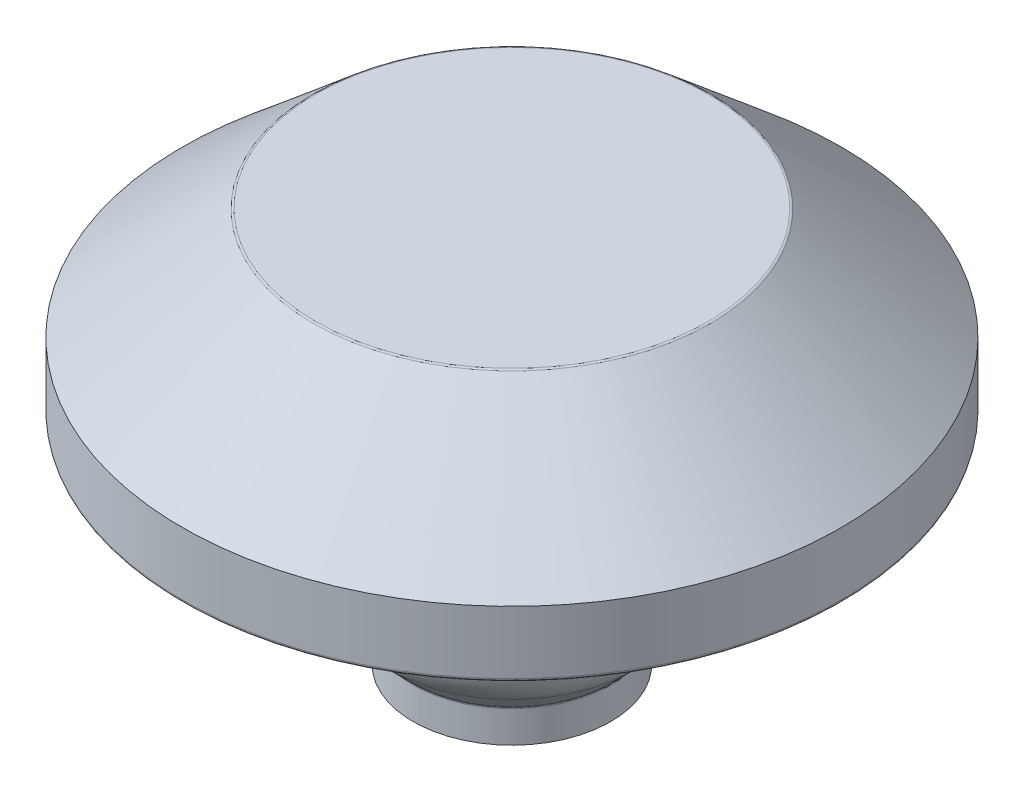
ISO-10303-21;
HEADER;
FILE_DESCRIPTION(('STEP AP214'),'2;1');
FILE_NAME('part.step','',(''),(''),'','','');
FILE_SCHEMA(('AUTOMOTIVE_DESIGN { 1 0 10303 214 1 1 1 1 }'));
ENDSEC;
DATA;
#1=APPLICATION_CONTEXT('core data for automotive mechanical design processes');
#2=APPLICATION_PROTOCOL_DEFINITION('international standard','automotive_design',2000,#1);
#3=PRODUCT_CONTEXT('',#1,'mechanical');
#4=PRODUCT('Part','Part','',(#3));
#5=PRODUCT_RELATED_PRODUCT_CATEGORY('part','',(#4));
#6=PRODUCT_DEFINITION_FORMATION('','',#4);
#7=PRODUCT_DEFINITION_CONTEXT('part definition',#1,'design');
#8=PRODUCT_DEFINITION('design','',#6,#7);
#9=PRODUCT_DEFINITION_SHAPE('','',#8);
#10=(LENGTH_UNIT() NAMED_UNIT(*) SI_UNIT(.MILLI.,.METRE.));
#11=(NAMED_UNIT(*) PLANE_ANGLE_UNIT() SI_UNIT($,.RADIAN.));
#12=(NAMED_UNIT(*) SI_UNIT($,.STERADIAN.) SOLID_ANGLE_UNIT());
#13=UNCERTAINTY_MEASURE_WITH_UNIT(LENGTH_MEASURE(1.E-05),#10,'distance_accuracy_value','');
#14=(GEOMETRIC_REPRESENTATION_CONTEXT(3) GLOBAL_UNCERTAINTY_ASSIGNED_CONTEXT((#13)) GLOBAL_UNIT_ASSIGNED_CONTEXT((#10,
#11,#12)) REPRESENTATION_CONTEXT('',''));
#15=CARTESIAN_POINT('',(0.,0.,0.));
#16=DIRECTION('',(0.,0.,1.));
#17=DIRECTION('',(1.,0.,0.));
#18=AXIS2_PLACEMENT_3D('',#15,#16,#17);
#19=CARTESIAN_POINT('',(0.,6.,0.));
#20=DIRECTION('',(0.,1.,0.));
#21=DIRECTION('',(0.,0.,1.));
#22=AXIS2_PLACEMENT_3D('',#19,#20,#21);
#23=PLANE('',#22);
#24=CARTESIAN_POINT('',(0.,6.,0.));
#25=DIRECTION('',(0.,1.,0.));
#26=DIRECTION('',(0.,0.,1.));
#27=AXIS2_PLACEMENT_3D('',#24,#25,#26);
#28=CIRCLE('',#27,2.98162114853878);
#29=CARTESIAN_POINT('',(0.,6.,2.98162114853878));
#30=VERTEX_POINT('',#29);
#31=EDGE_CURVE('E65',#30,#30,#28,.T.);
#32=ORIENTED_EDGE('',*,*,#31,.T.);
#33=EDGE_LOOP('',(#32));
#34=FACE_BOUND('',#33,.T.);
#35=ADVANCED_FACE('F39',(#34),#23,.T.);
#36=CARTESIAN_POINT('',(0.,4.3,0.));
#37=DIRECTION('',(0.,-1.,0.));
#38=DIRECTION('',(0.,0.,-1.));
#39=AXIS2_PLACEMENT_3D('',#36,#37,#38);
#40=CONICAL_SURFACE('',#39,5.,0.866302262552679);
#41=CARTESIAN_POINT('',(0.,5.98809696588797,0.));
#42=DIRECTION('',(0.,1.,0.));
#43=DIRECTION('',(0.,0.,1.));
#44=AXIS2_PLACEMENT_3D('',#41,#42,#43);
#45=CIRCLE('',#44,3.01400356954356);
#46=CARTESIAN_POINT('',(0.,5.98809696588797,3.01400356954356));
#47=VERTEX_POINT('',#46);
#48=EDGE_CURVE('E68',#47,#47,#45,.F.);
#49=ORIENTED_EDGE('',*,*,#48,.T.);
#50=EDGE_LOOP('',(#49));
#51=FACE_BOUND('',#50,.T.);
#52=CARTESIAN_POINT('',(0.,4.3,0.));
#53=DIRECTION('',(0.,-1.,0.));
#54=DIRECTION('',(0.,0.,-1.));
#55=AXIS2_PLACEMENT_3D('',#52,#53,#54);
#56=CIRCLE('',#55,5.);
#57=CARTESIAN_POINT('',(0.,4.3,-5.));
#58=VERTEX_POINT('',#57);
#59=EDGE_CURVE('E83',#58,#58,#56,.T.);
#60=ORIENTED_EDGE('',*,*,#59,.F.);
#61=EDGE_LOOP('',(#60));
#62=FACE_BOUND('',#61,.T.);
#63=ADVANCED_FACE('F110',(#51,#62),#40,.T.);
#64=CARTESIAN_POINT('',(0.,0.,0.));
#65=DIRECTION('',(0.,-1.,0.));
#66=DIRECTION('',(0.,0.,-1.));
#67=AXIS2_PLACEMENT_3D('',#64,#65,#66);
#68=CYLINDRICAL_SURFACE('',#67,5.);
#69=CARTESIAN_POINT('',(0.,3.35,0.));
#70=DIRECTION('',(0.,-1.,0.));
#71=DIRECTION('',(0.,0.,-1.));
#72=AXIS2_PLACEMENT_3D('',#69,#70,#71);
#73=CIRCLE('',#72,5.);
#74=CARTESIAN_POINT('',(0.,3.35,-5.));
#75=VERTEX_POINT('',#74);
#76=EDGE_CURVE('E54',#75,#75,#73,.F.);
#77=ORIENTED_EDGE('',*,*,#76,.T.);
#78=EDGE_LOOP('',(#77));
#79=FACE_BOUND('',#78,.T.);
#80=ORIENTED_EDGE('',*,*,#59,.T.);
#81=EDGE_LOOP('',(#80));
#82=FACE_BOUND('',#81,.T.);
#83=ADVANCED_FACE('F116',(#79,#82),#68,.T.);
#84=CARTESIAN_POINT('',(5.,3.3,0.));
#85=DIRECTION('',(0.,-1.,0.));
#86=DIRECTION('',(0.,0.,-1.));
#87=AXIS2_PLACEMENT_3D('',#84,#85,#86);
#88=PLANE('',#87);
#89=CARTESIAN_POINT('',(0.,3.3,0.));
#90=DIRECTION('',(0.,-1.,0.));
#91=DIRECTION('',(0.,0.,-1.));
#92=AXIS2_PLACEMENT_3D('',#89,#90,#91);
#93=CIRCLE('',#92,4.95);
#94=CARTESIAN_POINT('',(0.,3.3,-4.95));
#95=VERTEX_POINT('',#94);
#96=EDGE_CURVE('E59',#95,#95,#93,.T.);
#97=ORIENTED_EDGE('',*,*,#96,.T.);
#98=EDGE_LOOP('',(#97));
#99=FACE_BOUND('',#98,.T.);
#100=CARTESIAN_POINT('',(0.,3.3,0.));
#101=DIRECTION('',(0.,-1.,0.));
#102=DIRECTION('',(0.,0.,-1.));
#103=AXIS2_PLACEMENT_3D('',#100,#101,#102);
#104=CIRCLE('',#103,4.51384919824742);
#105=CARTESIAN_POINT('',(0.,3.3,-4.51384919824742));
#106=VERTEX_POINT('',#105);
#107=EDGE_CURVE('E62',#106,#106,#104,.F.);
#108=ORIENTED_EDGE('',*,*,#107,.T.);
#109=EDGE_LOOP('',(#108));
#110=FACE_BOUND('',#109,.T.);
#111=ADVANCED_FACE('F158',(#99,#110),#88,.T.);
#112=CARTESIAN_POINT('',(0.,4.8,0.));
#113=DIRECTION('',(0.,-1.,0.));
#114=DIRECTION('',(0.,0.,-1.));
#115=AXIS2_PLACEMENT_3D('',#112,#113,#114);
#116=CONICAL_SURFACE('',#115,2.,1.03037682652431);
#117=CARTESIAN_POINT('',(0.,4.75727357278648,0.));
#118=DIRECTION('',(0.,-1.,0.));
#119=DIRECTION('',(0.,0.,-1.));
#120=AXIS2_PLACEMENT_3D('',#117,#118,#119);
#121=CIRCLE('',#120,2.07121071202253);
#122=CARTESIAN_POINT('',(0.,4.75727357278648,-2.07121071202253));
#123=VERTEX_POINT('',#122);
#124=EDGE_CURVE('E71',#123,#123,#121,.F.);
#125=ORIENTED_EDGE('',*,*,#124,.T.);
#126=EDGE_LOOP('',(#125));
#127=FACE_BOUND('',#126,.T.);
#128=CARTESIAN_POINT('',(0.,3.30712535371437,0.));
#129=DIRECTION('',(0.,1.,0.));
#130=DIRECTION('',(0.,0.,1.));
#131=AXIS2_PLACEMENT_3D('',#128,#129,#130);
#132=CIRCLE('',#131,4.48812441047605);
#133=CARTESIAN_POINT('',(0.,3.30712535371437,4.48812441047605));
#134=VERTEX_POINT('',#133);
#135=EDGE_CURVE('E74',#134,#134,#132,.F.);
#136=ORIENTED_EDGE('',*,*,#135,.T.);
#137=EDGE_LOOP('',(#136));
#138=FACE_BOUND('',#137,.T.);
#139=ADVANCED_FACE('F150',(#127,#138),#116,.F.);
#140=CARTESIAN_POINT('',(0.,2.,0.));
#141=DIRECTION('',(0.,1.,0.));
#142=DIRECTION('',(0.,0.,1.));
#143=AXIS2_PLACEMENT_3D('',#140,#141,#142);
#144=CONICAL_SURFACE('',#143,1.85,0.0535202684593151);
#145=CARTESIAN_POINT('',(0.,4.71707366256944,0.));
#146=DIRECTION('',(0.,1.,0.));
#147=DIRECTION('',(0.,0.,1.));
#148=AXIS2_PLACEMENT_3D('',#145,#146,#147);
#149=CIRCLE('',#148,1.99555751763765);
#150=CARTESIAN_POINT('',(0.,4.71707366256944,1.99555751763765));
#151=VERTEX_POINT('',#150);
#152=EDGE_CURVE('E77',#151,#151,#149,.F.);
#153=ORIENTED_EDGE('',*,*,#152,.T.);
#154=EDGE_LOOP('',(#153));
#155=FACE_BOUND('',#154,.T.);
#156=CARTESIAN_POINT('',(0.,2.02186843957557,0.));
#157=DIRECTION('',(0.,1.,0.));
#158=DIRECTION('',(0.,0.,1.));
#159=AXIS2_PLACEMENT_3D('',#156,#157,#158);
#160=CIRCLE('',#159,1.85117152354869);
#161=CARTESIAN_POINT('',(0.,2.02186843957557,1.85117152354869));
#162=VERTEX_POINT('',#161);
#163=EDGE_CURVE('E80',#162,#162,#160,.T.);
#164=ORIENTED_EDGE('',*,*,#163,.T.);
#165=EDGE_LOOP('',(#164));
#166=FACE_BOUND('',#165,.T.);
#167=ADVANCED_FACE('F148',(#155,#166),#144,.T.);
#168=CARTESIAN_POINT('',(0.,1.425,0.));
#169=DIRECTION('',(0.,-1.,0.));
#170=DIRECTION('',(0.,0.,-1.));
#171=AXIS2_PLACEMENT_3D('',#168,#169,#170);
#172=TOROIDAL_SURFACE('',#171,1.275,0.813172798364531);
#173=CARTESIAN_POINT('',(0.,1.98477454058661,0.));
#174=DIRECTION('',(0.,-1.,0.));
#175=DIRECTION('',(0.,0.,-1.));
#176=AXIS2_PLACEMENT_3D('',#173,#174,#175);
#177=CIRCLE('',#176,1.86483257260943);
#178=CARTESIAN_POINT('',(0.,1.98477454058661,-1.86483257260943));
#179=VERTEX_POINT('',#178);
#180=EDGE_CURVE('E10',#179,#179,#177,.T.);
#181=ORIENTED_EDGE('',*,*,#180,.T.);
#182=EDGE_LOOP('',(#181));
#183=FACE_BOUND('',#182,.T.);
#184=CARTESIAN_POINT('',(0.,0.850000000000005,0.));
#185=DIRECTION('',(0.,-1.,0.));
#186=DIRECTION('',(0.,0.,-1.));
#187=AXIS2_PLACEMENT_3D('',#184,#185,#186);
#188=CIRCLE('',#187,1.85);
#189=CARTESIAN_POINT('',(0.,0.850000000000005,-1.85));
#190=VERTEX_POINT('',#189);
#191=EDGE_CURVE('E86',#190,#190,#188,.T.);
#192=ORIENTED_EDGE('',*,*,#191,.F.);
#193=EDGE_LOOP('',(#192));
#194=FACE_BOUND('',#193,.T.);
#195=ADVANCED_FACE('F107',(#183,#194),#172,.T.);
#196=CARTESIAN_POINT('',(0.,0.5,0.));
#197=DIRECTION('',(0.,1.,0.));
#198=DIRECTION('',(0.,0.,1.));
#199=AXIS2_PLACEMENT_3D('',#196,#197,#198);
#200=CONICAL_SURFACE('',#199,1.5,0.785398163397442);
#201=CARTESIAN_POINT('',(0.,0.514644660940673,0.));
#202=DIRECTION('',(0.,1.,0.));
#203=DIRECTION('',(0.,0.,1.));
#204=AXIS2_PLACEMENT_3D('',#201,#202,#203);
#205=CIRCLE('',#204,1.51464466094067);
#206=CARTESIAN_POINT('',(0.,0.514644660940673,1.51464466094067));
#207=VERTEX_POINT('',#206);
#208=EDGE_CURVE('E46',#207,#207,#205,.T.);
#209=ORIENTED_EDGE('',*,*,#208,.T.);
#210=EDGE_LOOP('',(#209));
#211=FACE_BOUND('',#210,.T.);
#212=ORIENTED_EDGE('',*,*,#191,.T.);
#213=EDGE_LOOP('',(#212));
#214=FACE_BOUND('',#213,.T.);
#215=ADVANCED_FACE('F97',(#211,#214),#200,.T.);
#216=CARTESIAN_POINT('',(0.,0.,0.));
#217=DIRECTION('',(0.,-1.,0.));
#218=DIRECTION('',(0.,0.,-1.));
#219=AXIS2_PLACEMENT_3D('',#216,#217,#218);
#220=CYLINDRICAL_SURFACE('',#219,1.5);
#221=CARTESIAN_POINT('',(0.,0.479289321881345,0.));
#222=DIRECTION('',(0.,-1.,0.));
#223=DIRECTION('',(0.,0.,-1.));
#224=AXIS2_PLACEMENT_3D('',#221,#222,#223);
#225=CIRCLE('',#224,1.5);
#226=CARTESIAN_POINT('',(0.,0.479289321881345,-1.5));
#227=VERTEX_POINT('',#226);
#228=EDGE_CURVE('E50',#227,#227,#225,.T.);
#229=ORIENTED_EDGE('',*,*,#228,.T.);
#230=EDGE_LOOP('',(#229));
#231=FACE_BOUND('',#230,.T.);
#232=CARTESIAN_POINT('',(0.,0.,0.));
#233=DIRECTION('',(0.,-1.,0.));
#234=DIRECTION('',(0.,0.,-1.));
#235=AXIS2_PLACEMENT_3D('',#232,#233,#234);
#236=CIRCLE('',#235,1.5);
#237=CARTESIAN_POINT('',(0.,0.,-1.5));
#238=VERTEX_POINT('',#237);
#239=EDGE_CURVE('E89',#238,#238,#236,.T.);
#240=ORIENTED_EDGE('',*,*,#239,.F.);
#241=EDGE_LOOP('',(#240));
#242=FACE_BOUND('',#241,.T.);
#243=ADVANCED_FACE('F95',(#231,#242),#220,.T.);
#244=CARTESIAN_POINT('',(1.5,0.,0.));
#245=DIRECTION('',(0.,-1.,0.));
#246=DIRECTION('',(0.,0.,-1.));
#247=AXIS2_PLACEMENT_3D('',#244,#245,#246);
#248=PLANE('',#247);
#249=ORIENTED_EDGE('',*,*,#239,.T.);
#250=EDGE_LOOP('',(#249));
#251=FACE_BOUND('',#250,.T.);
#252=ADVANCED_FACE('F93',(#251),#248,.T.);
#253=CARTESIAN_POINT('',(0.,4.71439892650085,0.));
#254=DIRECTION('',(0.,-1.,0.));
#255=DIRECTION('',(0.,0.,-1.));
#256=AXIS2_PLACEMENT_3D('',#253,#254,#255);
#257=TOROIDAL_SURFACE('',#256,2.04548592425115,0.05);
#258=ORIENTED_EDGE('',*,*,#124,.F.);
#259=EDGE_LOOP('',(#258));
#260=FACE_BOUND('',#259,.T.);
#261=ORIENTED_EDGE('',*,*,#152,.F.);
#262=EDGE_LOOP('',(#261));
#263=FACE_BOUND('',#262,.T.);
#264=ADVANCED_FACE('F105',(#260,#263),#257,.F.);
#265=CARTESIAN_POINT('',(0.,5.95,0.));
#266=DIRECTION('',(0.,1.,0.));
#267=DIRECTION('',(0.,0.,1.));
#268=AXIS2_PLACEMENT_3D('',#265,#266,#267);
#269=TOROIDAL_SURFACE('',#268,2.98162114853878,0.05);
#270=ORIENTED_EDGE('',*,*,#31,.F.);
#271=EDGE_LOOP('',(#270));
#272=FACE_BOUND('',#271,.T.);
#273=ORIENTED_EDGE('',*,*,#48,.F.);
#274=EDGE_LOOP('',(#273));
#275=FACE_BOUND('',#274,.T.);
#276=ADVANCED_FACE('F122',(#272,#275),#269,.T.);
#277=CARTESIAN_POINT('',(0.,3.35,0.));
#278=DIRECTION('',(0.,-1.,0.));
#279=DIRECTION('',(0.,0.,-1.));
#280=AXIS2_PLACEMENT_3D('',#277,#278,#279);
#281=TOROIDAL_SURFACE('',#280,4.95,0.05);
#282=ORIENTED_EDGE('',*,*,#76,.F.);
#283=EDGE_LOOP('',(#282));
#284=FACE_BOUND('',#283,.T.);
#285=ORIENTED_EDGE('',*,*,#96,.F.);
#286=EDGE_LOOP('',(#285));
#287=FACE_BOUND('',#286,.T.);
#288=ADVANCED_FACE('F126',(#284,#287),#281,.T.);
#289=CARTESIAN_POINT('',(0.,3.35,0.));
#290=DIRECTION('',(0.,-1.,0.));
#291=DIRECTION('',(0.,0.,-1.));
#292=AXIS2_PLACEMENT_3D('',#289,#290,#291);
#293=TOROIDAL_SURFACE('',#292,4.51384919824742,0.05);
#294=ORIENTED_EDGE('',*,*,#107,.F.);
#295=EDGE_LOOP('',(#294));
#296=FACE_BOUND('',#295,.T.);
#297=ORIENTED_EDGE('',*,*,#135,.F.);
#298=EDGE_LOOP('',(#297));
#299=FACE_BOUND('',#298,.T.);
#300=ADVANCED_FACE('F130',(#296,#299),#293,.T.);
#301=CARTESIAN_POINT('',(0.,0.479289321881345,0.));
#302=DIRECTION('',(0.,-1.,0.));
#303=DIRECTION('',(0.,0.,-1.));
#304=AXIS2_PLACEMENT_3D('',#301,#302,#303);
#305=TOROIDAL_SURFACE('',#304,1.55,0.05);
#306=ORIENTED_EDGE('',*,*,#208,.F.);
#307=EDGE_LOOP('',(#306));
#308=FACE_BOUND('',#307,.T.);
#309=ORIENTED_EDGE('',*,*,#228,.F.);
#310=EDGE_LOOP('',(#309));
#311=FACE_BOUND('',#310,.T.);
#312=ADVANCED_FACE('F133',(#308,#311),#305,.F.);
#313=CARTESIAN_POINT('',(0.,2.01919370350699,0.));
#314=DIRECTION('',(0.,-1.,0.));
#315=DIRECTION('',(0.,0.,-1.));
#316=AXIS2_PLACEMENT_3D('',#313,#314,#315);
#317=TOROIDAL_SURFACE('',#316,1.9010999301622,0.05);
#318=ORIENTED_EDGE('',*,*,#163,.F.);
#319=EDGE_LOOP('',(#318));
#320=FACE_BOUND('',#319,.T.);
#321=ORIENTED_EDGE('',*,*,#180,.F.);
#322=EDGE_LOOP('',(#321));
#323=FACE_BOUND('',#322,.T.);
#324=ADVANCED_FACE('F41',(#320,#323),#317,.F.);
#325=CLOSED_SHELL('',(#35,#63,#83,#111,#139,#167,#195,#215,#243,#252,#264,#276,#288,#300,#312,#324));
#326=MANIFOLD_SOLID_BREP('B2',#325);
#327=ADVANCED_BREP_SHAPE_REPRESENTATION('',(#18,#326),#14);
#328=SHAPE_DEFINITION_REPRESENTATION(#9,#327);
ENDSEC;
END-ISO-10303-21;
